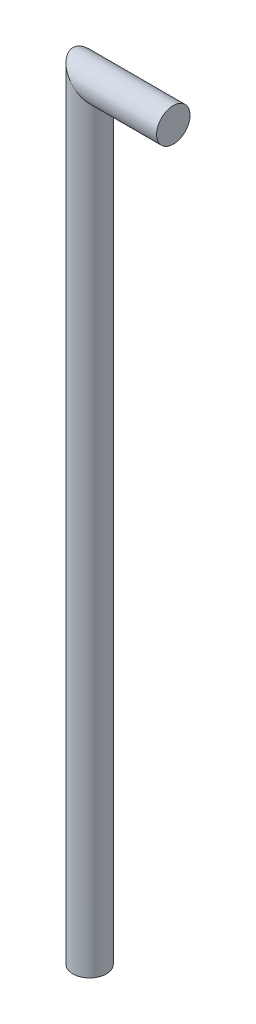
from build123d import *

# Parameters (mm, degrees)
CROQUIS14_R = 6


with BuildPart() as part:
    # Barrer3: sweep along a curve in space
    with BuildLine() as barrer3_path:
        Line((0, 0, 0), (0, 275.61, 0))
        Line((0, 275.61, 0), (30, 275.61, 0))
    # Croquis14 → Barrer3 (sweep)
    with BuildSketch(Plane.YZ.offset(30)):
        with Locations((275.61, 0)):
            Circle(CROQUIS14_R)
    sweep(path=barrer3_path.line, transition=Transition.RIGHT)


solid = part.part
